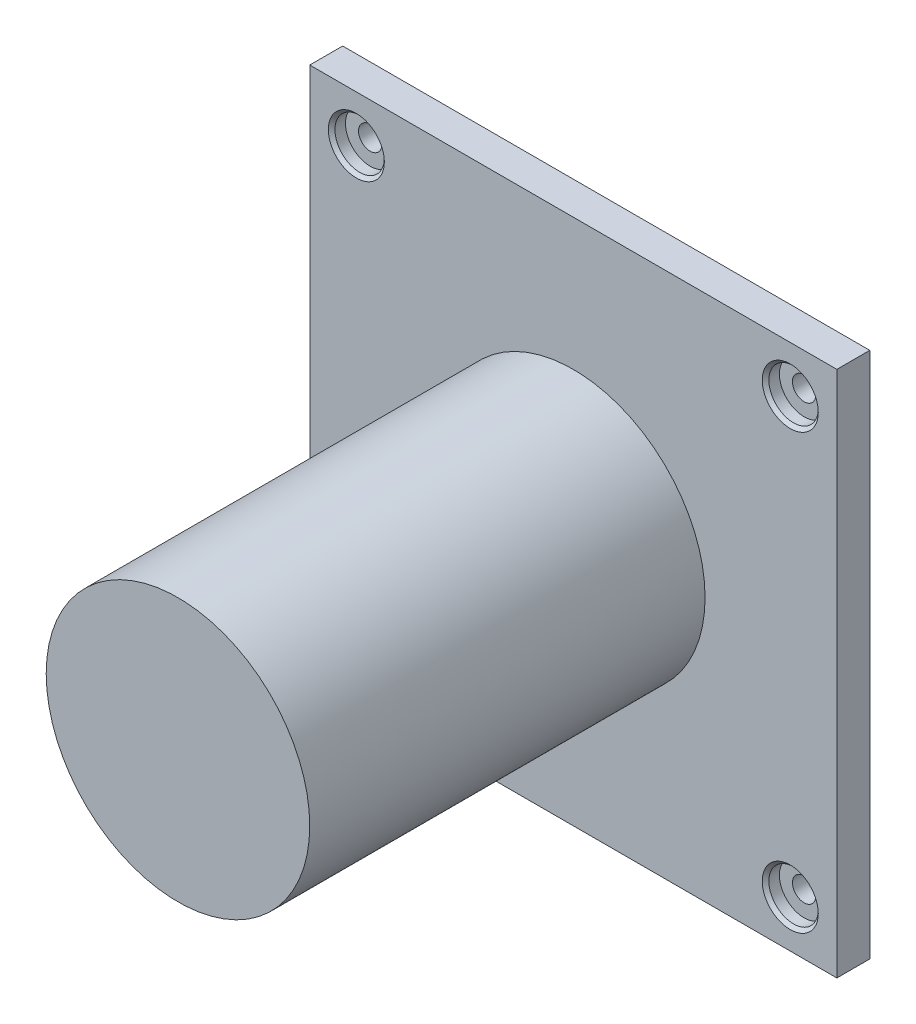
from build123d import *

# Parameters (mm, degrees)
SKETCH2_W                                   = 101.6
SKETCH2_H                                   = 101.6
BOSS_EXTRUDE1_DEPTH                         = 6.35
SKETCH3_R                                   = 25.4
BOSS_EXTRUDE2_DEPTH                         = 76.2
CBORE_FOR_8_BINDING_HEAD_MACHINE_SC_2_COUNT = 2
CBORE_FOR_8_BINDING_HEAD_MACHINE_SC_2_PITCH = 118.284097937
CBORE_FOR_8_BINDING_HEAD_MACHINE_SC_3_COUNT = 2
CBORE_FOR_8_BINDING_HEAD_MACHINE_SC_3_PITCH = 83.639487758
CBORE_FOR_8_BINDING_HEAD_MACHINE_SC_4_COUNT = 2
CBORE_FOR_8_BINDING_HEAD_MACHINE_SC_4_PITCH = 83.639487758


with BuildPart() as part:
    # Sketch2 → Boss-Extrude1 (new body)
    with BuildSketch(Plane.XY):
        with Locations((50.8, 50.8)):
            Rectangle(SKETCH2_W, SKETCH2_H)
    extrude(amount=BOSS_EXTRUDE1_DEPTH)

    # Sketch3 → Boss-Extrude2 (add)
    with BuildSketch(Plane.XY.offset(6.35)):
        with Locations(Location((50.8, 50.8, 0), (0, 0, 180))):
            Circle(SKETCH3_R)
    extrude(amount=BOSS_EXTRUDE2_DEPTH)

    # Sketch5 → CBORE for _8 Binding Head Machine Screw1 (revolve, cut)
    with BuildSketch(Plane(origin=(92.619743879, 8.980256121, 6.35), x_dir=(0, -1, 0), z_dir=(1, 0, 0))):
        Polygon((0, 0), (0, 6.35), (2.2479, 6.35), (2.2479, 2.667), (4.7625, 2.667), (4.7625, 0.635), (5.3975, 0), align=None)
    cbore_for_8_binding_head_machine_screw1 = revolve(axis=Axis((92.619743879, 8.980256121, 12.7), (0, 0, -1)), mode=Mode.SUBTRACT)

    # CBORE for _8 Binding Head Machine Sc 2: CBORE for _8 Binding Head Machine Screw1 ×2
    with Locations(*[Vector(-0.707106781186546, 0.707106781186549, 0) * (i * CBORE_FOR_8_BINDING_HEAD_MACHINE_SC_2_PITCH) for i in range(1, CBORE_FOR_8_BINDING_HEAD_MACHINE_SC_2_COUNT)]):
        add(cbore_for_8_binding_head_machine_screw1, mode=Mode.SUBTRACT)

    # CBORE for _8 Binding Head Machine Sc 3: CBORE for _8 Binding Head Machine Screw1 ×2
    with Locations(*[(0, i * CBORE_FOR_8_BINDING_HEAD_MACHINE_SC_3_PITCH, 0) for i in range(1, CBORE_FOR_8_BINDING_HEAD_MACHINE_SC_3_COUNT)]):
        add(cbore_for_8_binding_head_machine_screw1, mode=Mode.SUBTRACT)

    # CBORE for _8 Binding Head Machine Sc 4: CBORE for _8 Binding Head Machine Screw1 ×2
    with Locations(*[(-i * CBORE_FOR_8_BINDING_HEAD_MACHINE_SC_4_PITCH, 0, 0) for i in range(1, CBORE_FOR_8_BINDING_HEAD_MACHINE_SC_4_COUNT)]):
        add(cbore_for_8_binding_head_machine_screw1, mode=Mode.SUBTRACT)


solid = part.part
